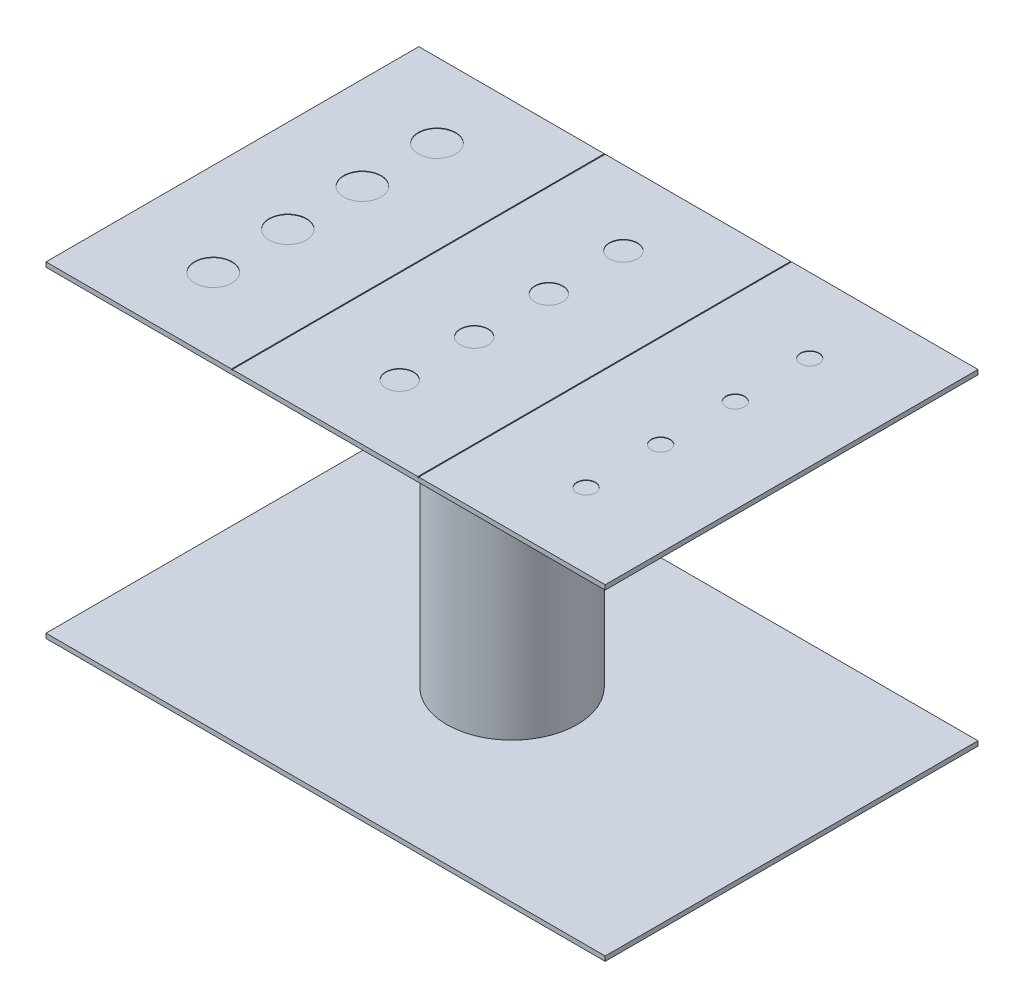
ISO-10303-21;
HEADER;
FILE_DESCRIPTION(('STEP AP214'),'2;1');
FILE_NAME('part.step','',(''),(''),'','','');
FILE_SCHEMA(('AUTOMOTIVE_DESIGN { 1 0 10303 214 1 1 1 1 }'));
ENDSEC;
DATA;
#1=APPLICATION_CONTEXT('core data for automotive mechanical design processes');
#2=APPLICATION_PROTOCOL_DEFINITION('international standard','automotive_design',2000,#1);
#3=PRODUCT_CONTEXT('',#1,'mechanical');
#4=PRODUCT('Part','Part','',(#3));
#5=PRODUCT_RELATED_PRODUCT_CATEGORY('part','',(#4));
#6=PRODUCT_DEFINITION_FORMATION('','',#4);
#7=PRODUCT_DEFINITION_CONTEXT('part definition',#1,'design');
#8=PRODUCT_DEFINITION('design','',#6,#7);
#9=PRODUCT_DEFINITION_SHAPE('','',#8);
#10=(LENGTH_UNIT() NAMED_UNIT(*) SI_UNIT(.MILLI.,.METRE.));
#11=(NAMED_UNIT(*) PLANE_ANGLE_UNIT() SI_UNIT($,.RADIAN.));
#12=(NAMED_UNIT(*) SI_UNIT($,.STERADIAN.) SOLID_ANGLE_UNIT());
#13=UNCERTAINTY_MEASURE_WITH_UNIT(LENGTH_MEASURE(1.E-05),#10,'distance_accuracy_value','');
#14=(GEOMETRIC_REPRESENTATION_CONTEXT(3) GLOBAL_UNCERTAINTY_ASSIGNED_CONTEXT((#13)) GLOBAL_UNIT_ASSIGNED_CONTEXT((#10,
#11,#12)) REPRESENTATION_CONTEXT('',''));
#15=CARTESIAN_POINT('',(0.,0.,0.));
#16=DIRECTION('',(0.,0.,1.));
#17=DIRECTION('',(1.,0.,0.));
#18=AXIS2_PLACEMENT_3D('',#15,#16,#17);
#19=CARTESIAN_POINT('',(0.,350.,0.));
#20=DIRECTION('',(0.,1.,0.));
#21=DIRECTION('',(0.,0.,1.));
#22=AXIS2_PLACEMENT_3D('',#19,#20,#21);
#23=PLANE('',#22);
#24=CARTESIAN_POINT('',(199.499999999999,350.,-120.));
#25=DIRECTION('',(0.,1.,0.));
#26=DIRECTION('',(0.,0.,1.));
#27=AXIS2_PLACEMENT_3D('',#24,#25,#26);
#28=CIRCLE('',#27,10.);
#29=CARTESIAN_POINT('',(199.499999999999,350.,-110.));
#30=VERTEX_POINT('',#29);
#31=EDGE_CURVE('E728',#30,#30,#28,.T.);
#32=ORIENTED_EDGE('',*,*,#31,.F.);
#33=EDGE_LOOP('',(#32));
#34=FACE_BOUND('',#33,.T.);
#35=CARTESIAN_POINT('',(199.499999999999,350.,-40.));
#36=DIRECTION('',(0.,1.,0.));
#37=DIRECTION('',(0.,0.,1.));
#38=AXIS2_PLACEMENT_3D('',#35,#36,#37);
#39=CIRCLE('',#38,10.);
#40=CARTESIAN_POINT('',(199.499999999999,350.,-30.));
#41=VERTEX_POINT('',#40);
#42=EDGE_CURVE('E729',#41,#41,#39,.T.);
#43=ORIENTED_EDGE('',*,*,#42,.F.);
#44=EDGE_LOOP('',(#43));
#45=FACE_BOUND('',#44,.T.);
#46=CARTESIAN_POINT('',(199.5,350.,40.));
#47=DIRECTION('',(0.,1.,0.));
#48=DIRECTION('',(0.,0.,1.));
#49=AXIS2_PLACEMENT_3D('',#46,#47,#48);
#50=CIRCLE('',#49,10.);
#51=CARTESIAN_POINT('',(199.5,350.,50.));
#52=VERTEX_POINT('',#51);
#53=EDGE_CURVE('E744',#52,#52,#50,.T.);
#54=ORIENTED_EDGE('',*,*,#53,.F.);
#55=EDGE_LOOP('',(#54));
#56=FACE_BOUND('',#55,.T.);
#57=CARTESIAN_POINT('',(199.5,350.,120.));
#58=DIRECTION('',(0.,1.,0.));
#59=DIRECTION('',(0.,0.,1.));
#60=AXIS2_PLACEMENT_3D('',#57,#58,#59);
#61=CIRCLE('',#60,10.);
#62=CARTESIAN_POINT('',(199.5,350.,130.));
#63=VERTEX_POINT('',#62);
#64=EDGE_CURVE('E752',#63,#63,#61,.T.);
#65=ORIENTED_EDGE('',*,*,#64,.F.);
#66=EDGE_LOOP('',(#65));
#67=FACE_BOUND('',#66,.T.);
#68=DIRECTION('',(-1.,0.,0.));
#69=VECTOR('',#68,1.);
#70=CARTESIAN_POINT('',(-300.,350.,-200.));
#71=LINE('',#70,#69);
#72=CARTESIAN_POINT('',(300.,350.,-200.));
#73=VERTEX_POINT('',#72);
#74=CARTESIAN_POINT('',(100.,350.,-199.999999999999));
#75=VERTEX_POINT('',#74);
#76=EDGE_CURVE('E249',#73,#75,#71,.T.);
#77=ORIENTED_EDGE('',*,*,#76,.T.);
#78=DIRECTION('',(0.,0.,1.));
#79=VECTOR('',#78,1.);
#80=CARTESIAN_POINT('',(100.,350.,-199.999999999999));
#81=LINE('',#80,#79);
#82=CARTESIAN_POINT('',(100.,350.,200.));
#83=VERTEX_POINT('',#82);
#84=EDGE_CURVE('E181',#75,#83,#81,.T.);
#85=ORIENTED_EDGE('',*,*,#84,.T.);
#86=DIRECTION('',(1.,0.,0.));
#87=VECTOR('',#86,1.);
#88=CARTESIAN_POINT('',(-300.,350.,200.));
#89=LINE('',#88,#87);
#90=CARTESIAN_POINT('',(300.,350.,200.));
#91=VERTEX_POINT('',#90);
#92=EDGE_CURVE('E257',#83,#91,#89,.T.);
#93=ORIENTED_EDGE('',*,*,#92,.T.);
#94=DIRECTION('',(0.,0.,-1.));
#95=VECTOR('',#94,1.);
#96=CARTESIAN_POINT('',(300.,350.,-200.));
#97=LINE('',#96,#95);
#98=EDGE_CURVE('E243',#91,#73,#97,.T.);
#99=ORIENTED_EDGE('',*,*,#98,.T.);
#100=EDGE_LOOP('',(#77,#85,#93,#99));
#101=FACE_BOUND('',#100,.T.);
#102=ADVANCED_FACE('F45',(#34,#45,#56,#67,#101),#23,.T.);
#103=CARTESIAN_POINT('',(-0.500000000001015,350.,-119.999999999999));
#104=DIRECTION('',(0.,1.,0.));
#105=DIRECTION('',(0.,0.,1.));
#106=AXIS2_PLACEMENT_3D('',#103,#104,#105);
#107=CIRCLE('',#106,15.);
#108=CARTESIAN_POINT('',(-0.500000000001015,350.,-104.999999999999));
#109=VERTEX_POINT('',#108);
#110=EDGE_CURVE('E775',#109,#109,#107,.T.);
#111=ORIENTED_EDGE('',*,*,#110,.F.);
#112=EDGE_LOOP('',(#111));
#113=FACE_BOUND('',#112,.T.);
#114=CARTESIAN_POINT('',(-0.500000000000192,350.,120.000000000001));
#115=DIRECTION('',(0.,1.,0.));
#116=DIRECTION('',(0.,0.,1.));
#117=AXIS2_PLACEMENT_3D('',#114,#115,#116);
#118=CIRCLE('',#117,15.);
#119=CARTESIAN_POINT('',(-0.500000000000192,350.,135.000000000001));
#120=VERTEX_POINT('',#119);
#121=EDGE_CURVE('E804',#120,#120,#118,.T.);
#122=ORIENTED_EDGE('',*,*,#121,.F.);
#123=EDGE_LOOP('',(#122));
#124=FACE_BOUND('',#123,.T.);
#125=CARTESIAN_POINT('',(-0.500000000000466,350.,40.0000000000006));
#126=DIRECTION('',(0.,1.,0.));
#127=DIRECTION('',(0.,0.,1.));
#128=AXIS2_PLACEMENT_3D('',#125,#126,#127);
#129=CIRCLE('',#128,15.);
#130=CARTESIAN_POINT('',(-0.500000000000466,350.,55.0000000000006));
#131=VERTEX_POINT('',#130);
#132=EDGE_CURVE('E796',#131,#131,#129,.T.);
#133=ORIENTED_EDGE('',*,*,#132,.F.);
#134=EDGE_LOOP('',(#133));
#135=FACE_BOUND('',#134,.T.);
#136=CARTESIAN_POINT('',(-0.50000000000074,350.,-39.9999999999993));
#137=DIRECTION('',(0.,1.,0.));
#138=DIRECTION('',(0.,0.,1.));
#139=AXIS2_PLACEMENT_3D('',#136,#137,#138);
#140=CIRCLE('',#139,15.);
#141=CARTESIAN_POINT('',(-0.50000000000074,350.,-24.9999999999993));
#142=VERTEX_POINT('',#141);
#143=EDGE_CURVE('E788',#142,#142,#140,.T.);
#144=ORIENTED_EDGE('',*,*,#143,.F.);
#145=EDGE_LOOP('',(#144));
#146=FACE_BOUND('',#145,.T.);
#147=DIRECTION('',(0.,0.,-1.));
#148=VECTOR('',#147,1.);
#149=CARTESIAN_POINT('',(99.0000000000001,350.,-199.999999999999));
#150=LINE('',#149,#148);
#151=CARTESIAN_POINT('',(99.0000000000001,350.,-199.999999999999));
#152=VERTEX_POINT('',#151);
#153=CARTESIAN_POINT('',(99.0000000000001,350.,200.000000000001));
#154=VERTEX_POINT('',#153);
#155=EDGE_CURVE('E166',#152,#154,#150,.F.);
#156=ORIENTED_EDGE('',*,*,#155,.F.);
#157=CARTESIAN_POINT('',(-99.9999999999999,350.,-199.999999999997));
#158=VERTEX_POINT('',#157);
#159=EDGE_CURVE('E254',#152,#158,#71,.T.);
#160=ORIENTED_EDGE('',*,*,#159,.T.);
#161=DIRECTION('',(0.,0.,1.));
#162=VECTOR('',#161,1.);
#163=CARTESIAN_POINT('',(-99.9999999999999,350.,-199.999999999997));
#164=LINE('',#163,#162);
#165=CARTESIAN_POINT('',(-99.9999999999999,350.,200.));
#166=VERTEX_POINT('',#165);
#167=EDGE_CURVE('E214',#158,#166,#164,.T.);
#168=ORIENTED_EDGE('',*,*,#167,.T.);
#169=EDGE_CURVE('E263',#166,#154,#89,.T.);
#170=ORIENTED_EDGE('',*,*,#169,.T.);
#171=EDGE_LOOP('',(#156,#160,#168,#170));
#172=FACE_BOUND('',#171,.T.);
#173=ADVANCED_FACE('F367',(#113,#124,#135,#146,#172),#23,.T.);
#174=CARTESIAN_POINT('',(300.,5.,-200.));
#175=DIRECTION('',(-1.,0.,0.));
#176=DIRECTION('',(0.,0.,1.));
#177=AXIS2_PLACEMENT_3D('',#174,#175,#176);
#178=PLANE('',#177);
#179=DIRECTION('',(0.,0.,-1.));
#180=VECTOR('',#179,1.);
#181=CARTESIAN_POINT('',(300.,0.,-200.));
#182=LINE('',#181,#180);
#183=CARTESIAN_POINT('',(300.,0.,200.));
#184=VERTEX_POINT('',#183);
#185=CARTESIAN_POINT('',(300.,0.,-200.));
#186=VERTEX_POINT('',#185);
#187=EDGE_CURVE('E293',#184,#186,#182,.T.);
#188=ORIENTED_EDGE('',*,*,#187,.T.);
#189=DIRECTION('',(0.,-1.,0.));
#190=VECTOR('',#189,1.);
#191=CARTESIAN_POINT('',(300.,5.,-200.));
#192=LINE('',#191,#190);
#193=CARTESIAN_POINT('',(300.,5.,-200.));
#194=VERTEX_POINT('',#193);
#195=EDGE_CURVE('E49',#194,#186,#192,.T.);
#196=ORIENTED_EDGE('',*,*,#195,.F.);
#197=DIRECTION('',(0.,0.,-1.));
#198=VECTOR('',#197,1.);
#199=CARTESIAN_POINT('',(300.,5.,-200.));
#200=LINE('',#199,#198);
#201=CARTESIAN_POINT('',(300.,5.,200.));
#202=VERTEX_POINT('',#201);
#203=EDGE_CURVE('E295',#202,#194,#200,.T.);
#204=ORIENTED_EDGE('',*,*,#203,.F.);
#205=DIRECTION('',(0.,-1.,0.));
#206=VECTOR('',#205,1.);
#207=CARTESIAN_POINT('',(300.,5.,200.));
#208=LINE('',#207,#206);
#209=EDGE_CURVE('E309',#202,#184,#208,.T.);
#210=ORIENTED_EDGE('',*,*,#209,.T.);
#211=EDGE_LOOP('',(#188,#196,#204,#210));
#212=FACE_BOUND('',#211,.T.);
#213=ADVANCED_FACE('F47',(#212),#178,.F.);
#214=CARTESIAN_POINT('',(-300.,5.,-200.));
#215=DIRECTION('',(0.,0.,1.));
#216=DIRECTION('',(1.,0.,0.));
#217=AXIS2_PLACEMENT_3D('',#214,#215,#216);
#218=PLANE('',#217);
#219=DIRECTION('',(-1.,0.,0.));
#220=VECTOR('',#219,1.);
#221=CARTESIAN_POINT('',(-300.,0.,-200.));
#222=LINE('',#221,#220);
#223=CARTESIAN_POINT('',(-300.,0.,-200.));
#224=VERTEX_POINT('',#223);
#225=EDGE_CURVE('E313',#186,#224,#222,.T.);
#226=ORIENTED_EDGE('',*,*,#225,.T.);
#227=DIRECTION('',(0.,-1.,0.));
#228=VECTOR('',#227,1.);
#229=CARTESIAN_POINT('',(-300.,5.,-200.));
#230=LINE('',#229,#228);
#231=CARTESIAN_POINT('',(-300.,5.,-200.));
#232=VERTEX_POINT('',#231);
#233=EDGE_CURVE('E327',#232,#224,#230,.T.);
#234=ORIENTED_EDGE('',*,*,#233,.F.);
#235=DIRECTION('',(-1.,0.,0.));
#236=VECTOR('',#235,1.);
#237=CARTESIAN_POINT('',(-300.,5.,-200.));
#238=LINE('',#237,#236);
#239=EDGE_CURVE('E299',#194,#232,#238,.T.);
#240=ORIENTED_EDGE('',*,*,#239,.F.);
#241=ORIENTED_EDGE('',*,*,#195,.T.);
#242=EDGE_LOOP('',(#226,#234,#240,#241));
#243=FACE_BOUND('',#242,.T.);
#244=ADVANCED_FACE('F338',(#243),#218,.F.);
#245=CARTESIAN_POINT('',(-300.,5.,-200.));
#246=DIRECTION('',(1.,0.,0.));
#247=DIRECTION('',(0.,0.,-1.));
#248=AXIS2_PLACEMENT_3D('',#245,#246,#247);
#249=PLANE('',#248);
#250=DIRECTION('',(0.,0.,1.));
#251=VECTOR('',#250,1.);
#252=CARTESIAN_POINT('',(-300.,0.,-200.));
#253=LINE('',#252,#251);
#254=CARTESIAN_POINT('',(-300.,0.,200.));
#255=VERTEX_POINT('',#254);
#256=EDGE_CURVE('E316',#224,#255,#253,.T.);
#257=ORIENTED_EDGE('',*,*,#256,.T.);
#258=DIRECTION('',(0.,-1.,0.));
#259=VECTOR('',#258,1.);
#260=CARTESIAN_POINT('',(-300.,5.,200.));
#261=LINE('',#260,#259);
#262=CARTESIAN_POINT('',(-300.,5.,200.));
#263=VERTEX_POINT('',#262);
#264=EDGE_CURVE('E324',#263,#255,#261,.T.);
#265=ORIENTED_EDGE('',*,*,#264,.F.);
#266=DIRECTION('',(0.,0.,1.));
#267=VECTOR('',#266,1.);
#268=CARTESIAN_POINT('',(-300.,5.,-200.));
#269=LINE('',#268,#267);
#270=EDGE_CURVE('E303',#232,#263,#269,.T.);
#271=ORIENTED_EDGE('',*,*,#270,.F.);
#272=ORIENTED_EDGE('',*,*,#233,.T.);
#273=EDGE_LOOP('',(#257,#265,#271,#272));
#274=FACE_BOUND('',#273,.T.);
#275=ADVANCED_FACE('F347',(#274),#249,.F.);
#276=CARTESIAN_POINT('',(-300.,5.,200.));
#277=DIRECTION('',(0.,0.,-1.));
#278=DIRECTION('',(-1.,0.,0.));
#279=AXIS2_PLACEMENT_3D('',#276,#277,#278);
#280=PLANE('',#279);
#281=DIRECTION('',(1.,0.,0.));
#282=VECTOR('',#281,1.);
#283=CARTESIAN_POINT('',(-300.,0.,200.));
#284=LINE('',#283,#282);
#285=EDGE_CURVE('E300',#255,#184,#284,.T.);
#286=ORIENTED_EDGE('',*,*,#285,.T.);
#287=ORIENTED_EDGE('',*,*,#209,.F.);
#288=DIRECTION('',(1.,0.,0.));
#289=VECTOR('',#288,1.);
#290=CARTESIAN_POINT('',(-300.,5.,200.));
#291=LINE('',#290,#289);
#292=EDGE_CURVE('E306',#263,#202,#291,.T.);
#293=ORIENTED_EDGE('',*,*,#292,.F.);
#294=ORIENTED_EDGE('',*,*,#264,.T.);
#295=EDGE_LOOP('',(#286,#287,#293,#294));
#296=FACE_BOUND('',#295,.T.);
#297=ADVANCED_FACE('F350',(#296),#280,.F.);
#298=CARTESIAN_POINT('',(0.,5.,0.));
#299=DIRECTION('',(0.,1.,0.));
#300=DIRECTION('',(0.,0.,1.));
#301=AXIS2_PLACEMENT_3D('',#298,#299,#300);
#302=PLANE('',#301);
#303=CARTESIAN_POINT('',(0.,5.,0.));
#304=DIRECTION('',(0.,1.,0.));
#305=DIRECTION('',(0.,0.,1.));
#306=AXIS2_PLACEMENT_3D('',#303,#304,#305);
#307=CIRCLE('',#306,70.);
#308=CARTESIAN_POINT('',(0.,5.,70.));
#309=VERTEX_POINT('',#308);
#310=EDGE_CURVE('E11',#309,#309,#307,.T.);
#311=ORIENTED_EDGE('',*,*,#310,.F.);
#312=EDGE_LOOP('',(#311));
#313=FACE_BOUND('',#312,.T.);
#314=ORIENTED_EDGE('',*,*,#203,.T.);
#315=ORIENTED_EDGE('',*,*,#239,.T.);
#316=ORIENTED_EDGE('',*,*,#270,.T.);
#317=ORIENTED_EDGE('',*,*,#292,.T.);
#318=EDGE_LOOP('',(#314,#315,#316,#317));
#319=FACE_BOUND('',#318,.T.);
#320=ADVANCED_FACE('F352',(#313,#319),#302,.T.);
#321=CARTESIAN_POINT('',(0.,0.,0.));
#322=DIRECTION('',(0.,1.,0.));
#323=DIRECTION('',(0.,0.,1.));
#324=AXIS2_PLACEMENT_3D('',#321,#322,#323);
#325=PLANE('',#324);
#326=ORIENTED_EDGE('',*,*,#187,.F.);
#327=ORIENTED_EDGE('',*,*,#285,.F.);
#328=ORIENTED_EDGE('',*,*,#256,.F.);
#329=ORIENTED_EDGE('',*,*,#225,.F.);
#330=EDGE_LOOP('',(#326,#327,#328,#329));
#331=FACE_BOUND('',#330,.T.);
#332=ADVANCED_FACE('F345',(#331),#325,.F.);
#333=CARTESIAN_POINT('',(0.,345.,0.));
#334=DIRECTION('',(0.,-1.,0.));
#335=DIRECTION('',(0.,0.,-1.));
#336=AXIS2_PLACEMENT_3D('',#333,#334,#335);
#337=CYLINDRICAL_SURFACE('',#336,70.);
#338=CARTESIAN_POINT('',(0.,345.,0.));
#339=DIRECTION('',(0.,1.,0.));
#340=DIRECTION('',(0.,0.,1.));
#341=AXIS2_PLACEMENT_3D('',#338,#339,#340);
#342=CIRCLE('',#341,70.);
#343=CARTESIAN_POINT('',(0.,345.,70.));
#344=VERTEX_POINT('',#343);
#345=EDGE_CURVE('E290',#344,#344,#342,.T.);
#346=ORIENTED_EDGE('',*,*,#345,.F.);
#347=EDGE_LOOP('',(#346));
#348=FACE_BOUND('',#347,.T.);
#349=ORIENTED_EDGE('',*,*,#310,.T.);
#350=EDGE_LOOP('',(#349));
#351=FACE_BOUND('',#350,.T.);
#352=ADVANCED_FACE('F360',(#348,#351),#337,.T.);
#353=CARTESIAN_POINT('',(300.,350.,-200.));
#354=DIRECTION('',(-1.,0.,0.));
#355=DIRECTION('',(0.,0.,1.));
#356=AXIS2_PLACEMENT_3D('',#353,#354,#355);
#357=PLANE('',#356);
#358=DIRECTION('',(0.,0.,-1.));
#359=VECTOR('',#358,1.);
#360=CARTESIAN_POINT('',(300.,345.,-200.));
#361=LINE('',#360,#359);
#362=CARTESIAN_POINT('',(300.,345.,200.));
#363=VERTEX_POINT('',#362);
#364=CARTESIAN_POINT('',(300.,345.,-200.));
#365=VERTEX_POINT('',#364);
#366=EDGE_CURVE('E202',#363,#365,#361,.T.);
#367=ORIENTED_EDGE('',*,*,#366,.T.);
#368=DIRECTION('',(0.,-1.,0.));
#369=VECTOR('',#368,1.);
#370=CARTESIAN_POINT('',(300.,350.,-200.));
#371=LINE('',#370,#369);
#372=EDGE_CURVE('E286',#73,#365,#371,.T.);
#373=ORIENTED_EDGE('',*,*,#372,.F.);
#374=ORIENTED_EDGE('',*,*,#98,.F.);
#375=DIRECTION('',(0.,-1.,0.));
#376=VECTOR('',#375,1.);
#377=CARTESIAN_POINT('',(300.,350.,200.));
#378=LINE('',#377,#376);
#379=EDGE_CURVE('E262',#91,#363,#378,.T.);
#380=ORIENTED_EDGE('',*,*,#379,.T.);
#381=EDGE_LOOP('',(#367,#373,#374,#380));
#382=FACE_BOUND('',#381,.T.);
#383=ADVANCED_FACE('F437',(#382),#357,.F.);
#384=CARTESIAN_POINT('',(-300.,350.,-200.));
#385=DIRECTION('',(0.,0.,1.));
#386=DIRECTION('',(1.,0.,0.));
#387=AXIS2_PLACEMENT_3D('',#384,#385,#386);
#388=PLANE('',#387);
#389=ORIENTED_EDGE('',*,*,#159,.F.);
#390=DIRECTION('',(0.,1.,0.));
#391=VECTOR('',#390,1.);
#392=CARTESIAN_POINT('',(99.0000000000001,349.,-199.999999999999));
#393=LINE('',#392,#391);
#394=CARTESIAN_POINT('',(99.0000000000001,349.,-199.999999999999));
#395=VERTEX_POINT('',#394);
#396=EDGE_CURVE('E199',#395,#152,#393,.T.);
#397=ORIENTED_EDGE('',*,*,#396,.F.);
#398=DIRECTION('',(1.,0.,0.));
#399=VECTOR('',#398,1.);
#400=CARTESIAN_POINT('',(99.0000000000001,349.,-199.999999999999));
#401=LINE('',#400,#399);
#402=CARTESIAN_POINT('',(100.,349.,-199.999999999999));
#403=VERTEX_POINT('',#402);
#404=EDGE_CURVE('E172',#395,#403,#401,.T.);
#405=ORIENTED_EDGE('',*,*,#404,.T.);
#406=DIRECTION('',(0.,1.,0.));
#407=VECTOR('',#406,1.);
#408=CARTESIAN_POINT('',(100.,349.,-199.999999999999));
#409=LINE('',#408,#407);
#410=EDGE_CURVE('E203',#403,#75,#409,.T.);
#411=ORIENTED_EDGE('',*,*,#410,.T.);
#412=ORIENTED_EDGE('',*,*,#76,.F.);
#413=ORIENTED_EDGE('',*,*,#372,.T.);
#414=DIRECTION('',(-1.,0.,0.));
#415=VECTOR('',#414,1.);
#416=CARTESIAN_POINT('',(-300.,345.,-200.));
#417=LINE('',#416,#415);
#418=CARTESIAN_POINT('',(-300.,345.,-200.));
#419=VERTEX_POINT('',#418);
#420=EDGE_CURVE('E267',#365,#419,#417,.T.);
#421=ORIENTED_EDGE('',*,*,#420,.T.);
#422=DIRECTION('',(0.,-1.,0.));
#423=VECTOR('',#422,1.);
#424=CARTESIAN_POINT('',(-300.,350.,-200.));
#425=LINE('',#424,#423);
#426=CARTESIAN_POINT('',(-300.,350.,-200.));
#427=VERTEX_POINT('',#426);
#428=EDGE_CURVE('E282',#427,#419,#425,.T.);
#429=ORIENTED_EDGE('',*,*,#428,.F.);
#430=CARTESIAN_POINT('',(-101.,350.,-199.999999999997));
#431=VERTEX_POINT('',#430);
#432=EDGE_CURVE('E247',#431,#427,#71,.T.);
#433=ORIENTED_EDGE('',*,*,#432,.F.);
#434=DIRECTION('',(0.,1.,0.));
#435=VECTOR('',#434,1.);
#436=CARTESIAN_POINT('',(-101.,349.,-199.999999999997));
#437=LINE('',#436,#435);
#438=CARTESIAN_POINT('',(-101.,349.,-199.999999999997));
#439=VERTEX_POINT('',#438);
#440=EDGE_CURVE('E196',#439,#431,#437,.T.);
#441=ORIENTED_EDGE('',*,*,#440,.F.);
#442=DIRECTION('',(1.,0.,0.));
#443=VECTOR('',#442,1.);
#444=CARTESIAN_POINT('',(-101.,349.,-199.999999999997));
#445=LINE('',#444,#443);
#446=CARTESIAN_POINT('',(-99.9999999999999,349.,-199.999999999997));
#447=VERTEX_POINT('',#446);
#448=EDGE_CURVE('E221',#439,#447,#445,.T.);
#449=ORIENTED_EDGE('',*,*,#448,.T.);
#450=DIRECTION('',(0.,1.,0.));
#451=VECTOR('',#450,1.);
#452=CARTESIAN_POINT('',(-99.9999999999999,349.,-199.999999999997));
#453=LINE('',#452,#451);
#454=EDGE_CURVE('E234',#447,#158,#453,.T.);
#455=ORIENTED_EDGE('',*,*,#454,.T.);
#456=EDGE_LOOP('',(#389,#397,#405,#411,#412,#413,#421,#429,#433,#441,#449,#455));
#457=FACE_BOUND('',#456,.T.);
#458=ADVANCED_FACE('F416',(#457),#388,.F.);
#459=CARTESIAN_POINT('',(-300.,350.,-200.));
#460=DIRECTION('',(1.,0.,0.));
#461=DIRECTION('',(0.,0.,-1.));
#462=AXIS2_PLACEMENT_3D('',#459,#460,#461);
#463=PLANE('',#462);
#464=DIRECTION('',(0.,0.,1.));
#465=VECTOR('',#464,1.);
#466=CARTESIAN_POINT('',(-300.,345.,-200.));
#467=LINE('',#466,#465);
#468=CARTESIAN_POINT('',(-300.,345.,200.));
#469=VERTEX_POINT('',#468);
#470=EDGE_CURVE('E270',#419,#469,#467,.T.);
#471=ORIENTED_EDGE('',*,*,#470,.T.);
#472=DIRECTION('',(0.,-1.,0.));
#473=VECTOR('',#472,1.);
#474=CARTESIAN_POINT('',(-300.,350.,200.));
#475=LINE('',#474,#473);
#476=CARTESIAN_POINT('',(-300.,350.,200.));
#477=VERTEX_POINT('',#476);
#478=EDGE_CURVE('E278',#477,#469,#475,.T.);
#479=ORIENTED_EDGE('',*,*,#478,.F.);
#480=DIRECTION('',(0.,0.,1.));
#481=VECTOR('',#480,1.);
#482=CARTESIAN_POINT('',(-300.,350.,-200.));
#483=LINE('',#482,#481);
#484=EDGE_CURVE('E253',#427,#477,#483,.T.);
#485=ORIENTED_EDGE('',*,*,#484,.F.);
#486=ORIENTED_EDGE('',*,*,#428,.T.);
#487=EDGE_LOOP('',(#471,#479,#485,#486));
#488=FACE_BOUND('',#487,.T.);
#489=ADVANCED_FACE('F390',(#488),#463,.F.);
#490=CARTESIAN_POINT('',(-300.,350.,200.));
#491=DIRECTION('',(0.,0.,-1.));
#492=DIRECTION('',(-1.,0.,0.));
#493=AXIS2_PLACEMENT_3D('',#490,#491,#492);
#494=PLANE('',#493);
#495=DIRECTION('',(-1.,0.,0.));
#496=VECTOR('',#495,1.);
#497=CARTESIAN_POINT('',(100.,349.,200.000000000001));
#498=LINE('',#497,#496);
#499=CARTESIAN_POINT('',(100.,349.,200.000000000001));
#500=VERTEX_POINT('',#499);
#501=CARTESIAN_POINT('',(99.0000000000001,349.,200.000000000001));
#502=VERTEX_POINT('',#501);
#503=EDGE_CURVE('E178',#500,#502,#498,.T.);
#504=ORIENTED_EDGE('',*,*,#503,.T.);
#505=DIRECTION('',(0.,1.,0.));
#506=VECTOR('',#505,1.);
#507=CARTESIAN_POINT('',(99.0000000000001,349.,200.000000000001));
#508=LINE('',#507,#506);
#509=EDGE_CURVE('E160',#502,#154,#508,.T.);
#510=ORIENTED_EDGE('',*,*,#509,.T.);
#511=ORIENTED_EDGE('',*,*,#169,.F.);
#512=DIRECTION('',(0.,1.,0.));
#513=VECTOR('',#512,1.);
#514=CARTESIAN_POINT('',(-99.9999999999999,349.,200.000000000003));
#515=LINE('',#514,#513);
#516=CARTESIAN_POINT('',(-99.9999999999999,349.,200.000000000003));
#517=VERTEX_POINT('',#516);
#518=EDGE_CURVE('E70',#517,#166,#515,.T.);
#519=ORIENTED_EDGE('',*,*,#518,.F.);
#520=DIRECTION('',(-1.,0.,0.));
#521=VECTOR('',#520,1.);
#522=CARTESIAN_POINT('',(-99.9999999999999,349.,200.000000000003));
#523=LINE('',#522,#521);
#524=CARTESIAN_POINT('',(-101.,349.,200.000000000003));
#525=VERTEX_POINT('',#524);
#526=EDGE_CURVE('E213',#517,#525,#523,.T.);
#527=ORIENTED_EDGE('',*,*,#526,.T.);
#528=DIRECTION('',(0.,1.,0.));
#529=VECTOR('',#528,1.);
#530=CARTESIAN_POINT('',(-101.,349.,200.000000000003));
#531=LINE('',#530,#529);
#532=CARTESIAN_POINT('',(-101.,350.,200.000000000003));
#533=VERTEX_POINT('',#532);
#534=EDGE_CURVE('E225',#525,#533,#531,.T.);
#535=ORIENTED_EDGE('',*,*,#534,.T.);
#536=EDGE_CURVE('E258',#477,#533,#89,.T.);
#537=ORIENTED_EDGE('',*,*,#536,.F.);
#538=ORIENTED_EDGE('',*,*,#478,.T.);
#539=DIRECTION('',(1.,0.,0.));
#540=VECTOR('',#539,1.);
#541=CARTESIAN_POINT('',(-300.,345.,200.));
#542=LINE('',#541,#540);
#543=EDGE_CURVE('E248',#469,#363,#542,.T.);
#544=ORIENTED_EDGE('',*,*,#543,.T.);
#545=ORIENTED_EDGE('',*,*,#379,.F.);
#546=ORIENTED_EDGE('',*,*,#92,.F.);
#547=DIRECTION('',(0.,1.,0.));
#548=VECTOR('',#547,1.);
#549=CARTESIAN_POINT('',(100.,349.,200.000000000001));
#550=LINE('',#549,#548);
#551=EDGE_CURVE('E62',#500,#83,#550,.T.);
#552=ORIENTED_EDGE('',*,*,#551,.F.);
#553=EDGE_LOOP('',(#504,#510,#511,#519,#527,#535,#537,#538,#544,#545,#546,#552));
#554=FACE_BOUND('',#553,.T.);
#555=ADVANCED_FACE('F183',(#554),#494,.F.);
#556=CARTESIAN_POINT('',(-200.5,350.,120.));
#557=DIRECTION('',(0.,1.,0.));
#558=DIRECTION('',(0.,0.,1.));
#559=AXIS2_PLACEMENT_3D('',#556,#557,#558);
#560=CIRCLE('',#559,20.);
#561=CARTESIAN_POINT('',(-200.5,350.,140.));
#562=VERTEX_POINT('',#561);
#563=EDGE_CURVE('E395',#562,#562,#560,.T.);
#564=ORIENTED_EDGE('',*,*,#563,.F.);
#565=EDGE_LOOP('',(#564));
#566=FACE_BOUND('',#565,.T.);
#567=CARTESIAN_POINT('',(-200.5,350.,40.));
#568=DIRECTION('',(0.,1.,0.));
#569=DIRECTION('',(0.,0.,1.));
#570=AXIS2_PLACEMENT_3D('',#567,#568,#569);
#571=CIRCLE('',#570,20.);
#572=CARTESIAN_POINT('',(-200.5,350.,60.));
#573=VERTEX_POINT('',#572);
#574=EDGE_CURVE('E399',#573,#573,#571,.T.);
#575=ORIENTED_EDGE('',*,*,#574,.F.);
#576=EDGE_LOOP('',(#575));
#577=FACE_BOUND('',#576,.T.);
#578=CARTESIAN_POINT('',(-200.500000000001,350.,-40.));
#579=DIRECTION('',(0.,1.,0.));
#580=DIRECTION('',(0.,0.,1.));
#581=AXIS2_PLACEMENT_3D('',#578,#579,#580);
#582=CIRCLE('',#581,20.);
#583=CARTESIAN_POINT('',(-200.500000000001,350.,-20.));
#584=VERTEX_POINT('',#583);
#585=EDGE_CURVE('E403',#584,#584,#582,.T.);
#586=ORIENTED_EDGE('',*,*,#585,.F.);
#587=EDGE_LOOP('',(#586));
#588=FACE_BOUND('',#587,.T.);
#589=CARTESIAN_POINT('',(-200.500000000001,350.,-120.));
#590=DIRECTION('',(0.,1.,0.));
#591=DIRECTION('',(0.,0.,1.));
#592=AXIS2_PLACEMENT_3D('',#589,#590,#591);
#593=CIRCLE('',#592,20.);
#594=CARTESIAN_POINT('',(-200.500000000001,350.,-100.));
#595=VERTEX_POINT('',#594);
#596=EDGE_CURVE('E407',#595,#595,#593,.T.);
#597=ORIENTED_EDGE('',*,*,#596,.F.);
#598=EDGE_LOOP('',(#597));
#599=FACE_BOUND('',#598,.T.);
#600=DIRECTION('',(0.,0.,-1.));
#601=VECTOR('',#600,1.);
#602=CARTESIAN_POINT('',(-101.,350.,-199.999999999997));
#603=LINE('',#602,#601);
#604=EDGE_CURVE('E226',#431,#533,#603,.F.);
#605=ORIENTED_EDGE('',*,*,#604,.F.);
#606=ORIENTED_EDGE('',*,*,#432,.T.);
#607=ORIENTED_EDGE('',*,*,#484,.T.);
#608=ORIENTED_EDGE('',*,*,#536,.T.);
#609=EDGE_LOOP('',(#605,#606,#607,#608));
#610=FACE_BOUND('',#609,.T.);
#611=ADVANCED_FACE('F370',(#566,#577,#588,#599,#610),#23,.T.);
#612=CARTESIAN_POINT('',(0.,345.,0.));
#613=DIRECTION('',(0.,1.,0.));
#614=DIRECTION('',(0.,0.,1.));
#615=AXIS2_PLACEMENT_3D('',#612,#613,#614);
#616=PLANE('',#615);
#617=ORIENTED_EDGE('',*,*,#345,.T.);
#618=EDGE_LOOP('',(#617));
#619=FACE_BOUND('',#618,.T.);
#620=ORIENTED_EDGE('',*,*,#366,.F.);
#621=ORIENTED_EDGE('',*,*,#543,.F.);
#622=ORIENTED_EDGE('',*,*,#470,.F.);
#623=ORIENTED_EDGE('',*,*,#420,.F.);
#624=EDGE_LOOP('',(#620,#621,#622,#623));
#625=FACE_BOUND('',#624,.T.);
#626=ADVANCED_FACE('F381',(#619,#625),#616,.F.);
#627=CARTESIAN_POINT('',(-101.,349.,-199.999999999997));
#628=DIRECTION('',(-1.,0.,0.));
#629=DIRECTION('',(0.,0.,1.));
#630=AXIS2_PLACEMENT_3D('',#627,#628,#629);
#631=PLANE('',#630);
#632=ORIENTED_EDGE('',*,*,#604,.T.);
#633=ORIENTED_EDGE('',*,*,#534,.F.);
#634=DIRECTION('',(0.,0.,-1.));
#635=VECTOR('',#634,1.);
#636=CARTESIAN_POINT('',(-101.,349.,-199.999999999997));
#637=LINE('',#636,#635);
#638=EDGE_CURVE('E209',#439,#525,#637,.F.);
#639=ORIENTED_EDGE('',*,*,#638,.F.);
#640=ORIENTED_EDGE('',*,*,#440,.T.);
#641=EDGE_LOOP('',(#632,#633,#639,#640));
#642=FACE_BOUND('',#641,.T.);
#643=ADVANCED_FACE('F387',(#642),#631,.F.);
#644=CARTESIAN_POINT('',(-99.9999999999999,349.,-199.999999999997));
#645=DIRECTION('',(-1.,0.,0.));
#646=DIRECTION('',(0.,0.,1.));
#647=AXIS2_PLACEMENT_3D('',#644,#645,#646);
#648=PLANE('',#647);
#649=ORIENTED_EDGE('',*,*,#167,.F.);
#650=ORIENTED_EDGE('',*,*,#454,.F.);
#651=DIRECTION('',(0.,0.,1.));
#652=VECTOR('',#651,1.);
#653=CARTESIAN_POINT('',(-99.9999999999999,349.,-199.999999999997));
#654=LINE('',#653,#652);
#655=EDGE_CURVE('E218',#447,#517,#654,.T.);
#656=ORIENTED_EDGE('',*,*,#655,.T.);
#657=ORIENTED_EDGE('',*,*,#518,.T.);
#658=EDGE_LOOP('',(#649,#650,#656,#657));
#659=FACE_BOUND('',#658,.T.);
#660=ADVANCED_FACE('F423',(#659),#648,.T.);
#661=CARTESIAN_POINT('',(0.,349.,0.));
#662=DIRECTION('',(0.,1.,0.));
#663=DIRECTION('',(1.,0.,0.));
#664=AXIS2_PLACEMENT_3D('',#661,#662,#663);
#665=PLANE('',#664);
#666=ORIENTED_EDGE('',*,*,#638,.T.);
#667=ORIENTED_EDGE('',*,*,#526,.F.);
#668=ORIENTED_EDGE('',*,*,#655,.F.);
#669=ORIENTED_EDGE('',*,*,#448,.F.);
#670=EDGE_LOOP('',(#666,#667,#668,#669));
#671=FACE_BOUND('',#670,.T.);
#672=ADVANCED_FACE('F426',(#671),#665,.T.);
#673=CARTESIAN_POINT('',(99.0000000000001,349.,-199.999999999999));
#674=DIRECTION('',(-1.,0.,0.));
#675=DIRECTION('',(0.,0.,1.));
#676=AXIS2_PLACEMENT_3D('',#673,#674,#675);
#677=PLANE('',#676);
#678=ORIENTED_EDGE('',*,*,#155,.T.);
#679=ORIENTED_EDGE('',*,*,#509,.F.);
#680=DIRECTION('',(0.,0.,-1.));
#681=VECTOR('',#680,1.);
#682=CARTESIAN_POINT('',(99.0000000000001,349.,-199.999999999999));
#683=LINE('',#682,#681);
#684=EDGE_CURVE('E163',#395,#502,#683,.F.);
#685=ORIENTED_EDGE('',*,*,#684,.F.);
#686=ORIENTED_EDGE('',*,*,#396,.T.);
#687=EDGE_LOOP('',(#678,#679,#685,#686));
#688=FACE_BOUND('',#687,.T.);
#689=ADVANCED_FACE('F162',(#688),#677,.F.);
#690=CARTESIAN_POINT('',(100.,349.,-199.999999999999));
#691=DIRECTION('',(-1.,0.,0.));
#692=DIRECTION('',(0.,0.,1.));
#693=AXIS2_PLACEMENT_3D('',#690,#691,#692);
#694=PLANE('',#693);
#695=ORIENTED_EDGE('',*,*,#84,.F.);
#696=ORIENTED_EDGE('',*,*,#410,.F.);
#697=DIRECTION('',(0.,0.,1.));
#698=VECTOR('',#697,1.);
#699=CARTESIAN_POINT('',(100.,349.,-199.999999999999));
#700=LINE('',#699,#698);
#701=EDGE_CURVE('E186',#403,#500,#700,.T.);
#702=ORIENTED_EDGE('',*,*,#701,.T.);
#703=ORIENTED_EDGE('',*,*,#551,.T.);
#704=EDGE_LOOP('',(#695,#696,#702,#703));
#705=FACE_BOUND('',#704,.T.);
#706=ADVANCED_FACE('F438',(#705),#694,.T.);
#707=CARTESIAN_POINT('',(0.,349.,0.));
#708=DIRECTION('',(0.,1.,0.));
#709=DIRECTION('',(1.,0.,0.));
#710=AXIS2_PLACEMENT_3D('',#707,#708,#709);
#711=PLANE('',#710);
#712=ORIENTED_EDGE('',*,*,#684,.T.);
#713=ORIENTED_EDGE('',*,*,#503,.F.);
#714=ORIENTED_EDGE('',*,*,#701,.F.);
#715=ORIENTED_EDGE('',*,*,#404,.F.);
#716=EDGE_LOOP('',(#712,#713,#714,#715));
#717=FACE_BOUND('',#716,.T.);
#718=ADVANCED_FACE('F176',(#717),#711,.T.);
#719=CARTESIAN_POINT('',(-200.500000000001,349.5,-120.));
#720=DIRECTION('',(0.,1.,0.));
#721=DIRECTION('',(0.,0.,1.));
#722=AXIS2_PLACEMENT_3D('',#719,#720,#721);
#723=CYLINDRICAL_SURFACE('',#722,20.);
#724=CARTESIAN_POINT('',(-200.500000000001,349.5,-120.));
#725=DIRECTION('',(0.,1.,0.));
#726=DIRECTION('',(0.,0.,1.));
#727=AXIS2_PLACEMENT_3D('',#724,#725,#726);
#728=CIRCLE('',#727,20.);
#729=CARTESIAN_POINT('',(-200.500000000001,349.5,-100.));
#730=VERTEX_POINT('',#729);
#731=EDGE_CURVE('E229',#730,#730,#728,.T.);
#732=ORIENTED_EDGE('',*,*,#731,.F.);
#733=EDGE_LOOP('',(#732));
#734=FACE_BOUND('',#733,.T.);
#735=ORIENTED_EDGE('',*,*,#596,.T.);
#736=EDGE_LOOP('',(#735));
#737=FACE_BOUND('',#736,.T.);
#738=ADVANCED_FACE('F444',(#734,#737),#723,.F.);
#739=CARTESIAN_POINT('',(-200.500000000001,349.5,-120.));
#740=DIRECTION('',(0.,1.,0.));
#741=DIRECTION('',(0.,0.,1.));
#742=AXIS2_PLACEMENT_3D('',#739,#740,#741);
#743=PLANE('',#742);
#744=ORIENTED_EDGE('',*,*,#731,.T.);
#745=EDGE_LOOP('',(#744));
#746=FACE_BOUND('',#745,.T.);
#747=ADVANCED_FACE('F492',(#746),#743,.T.);
#748=CARTESIAN_POINT('',(-200.500000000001,349.5,-40.));
#749=DIRECTION('',(0.,1.,0.));
#750=DIRECTION('',(0.,0.,1.));
#751=AXIS2_PLACEMENT_3D('',#748,#749,#750);
#752=CYLINDRICAL_SURFACE('',#751,20.);
#753=CARTESIAN_POINT('',(-200.500000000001,349.5,-40.));
#754=DIRECTION('',(0.,1.,0.));
#755=DIRECTION('',(0.,0.,1.));
#756=AXIS2_PLACEMENT_3D('',#753,#754,#755);
#757=CIRCLE('',#756,20.);
#758=CARTESIAN_POINT('',(-200.500000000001,349.5,-20.));
#759=VERTEX_POINT('',#758);
#760=EDGE_CURVE('E756',#759,#759,#757,.T.);
#761=ORIENTED_EDGE('',*,*,#760,.F.);
#762=EDGE_LOOP('',(#761));
#763=FACE_BOUND('',#762,.T.);
#764=ORIENTED_EDGE('',*,*,#585,.T.);
#765=EDGE_LOOP('',(#764));
#766=FACE_BOUND('',#765,.T.);
#767=ADVANCED_FACE('F501',(#763,#766),#752,.F.);
#768=CARTESIAN_POINT('',(-200.500000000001,349.5,-40.));
#769=DIRECTION('',(0.,1.,0.));
#770=DIRECTION('',(0.,0.,1.));
#771=AXIS2_PLACEMENT_3D('',#768,#769,#770);
#772=PLANE('',#771);
#773=ORIENTED_EDGE('',*,*,#760,.T.);
#774=EDGE_LOOP('',(#773));
#775=FACE_BOUND('',#774,.T.);
#776=ADVANCED_FACE('F511',(#775),#772,.T.);
#777=CARTESIAN_POINT('',(-200.5,349.5,40.));
#778=DIRECTION('',(0.,1.,0.));
#779=DIRECTION('',(0.,0.,1.));
#780=AXIS2_PLACEMENT_3D('',#777,#778,#779);
#781=CYLINDRICAL_SURFACE('',#780,20.);
#782=CARTESIAN_POINT('',(-200.5,349.5,40.));
#783=DIRECTION('',(0.,1.,0.));
#784=DIRECTION('',(0.,0.,1.));
#785=AXIS2_PLACEMENT_3D('',#782,#783,#784);
#786=CIRCLE('',#785,20.);
#787=CARTESIAN_POINT('',(-200.5,349.5,60.));
#788=VERTEX_POINT('',#787);
#789=EDGE_CURVE('E762',#788,#788,#786,.T.);
#790=ORIENTED_EDGE('',*,*,#789,.F.);
#791=EDGE_LOOP('',(#790));
#792=FACE_BOUND('',#791,.T.);
#793=ORIENTED_EDGE('',*,*,#574,.T.);
#794=EDGE_LOOP('',(#793));
#795=FACE_BOUND('',#794,.T.);
#796=ADVANCED_FACE('F521',(#792,#795),#781,.F.);
#797=CARTESIAN_POINT('',(-200.5,349.5,40.));
#798=DIRECTION('',(0.,1.,0.));
#799=DIRECTION('',(0.,0.,1.));
#800=AXIS2_PLACEMENT_3D('',#797,#798,#799);
#801=PLANE('',#800);
#802=ORIENTED_EDGE('',*,*,#789,.T.);
#803=EDGE_LOOP('',(#802));
#804=FACE_BOUND('',#803,.T.);
#805=ADVANCED_FACE('F531',(#804),#801,.T.);
#806=CARTESIAN_POINT('',(-200.5,349.5,120.));
#807=DIRECTION('',(0.,1.,0.));
#808=DIRECTION('',(0.,0.,1.));
#809=AXIS2_PLACEMENT_3D('',#806,#807,#808);
#810=CYLINDRICAL_SURFACE('',#809,20.);
#811=CARTESIAN_POINT('',(-200.5,349.5,120.));
#812=DIRECTION('',(0.,1.,0.));
#813=DIRECTION('',(0.,0.,1.));
#814=AXIS2_PLACEMENT_3D('',#811,#812,#813);
#815=CIRCLE('',#814,20.);
#816=CARTESIAN_POINT('',(-200.5,349.5,140.));
#817=VERTEX_POINT('',#816);
#818=EDGE_CURVE('E768',#817,#817,#815,.T.);
#819=ORIENTED_EDGE('',*,*,#818,.F.);
#820=EDGE_LOOP('',(#819));
#821=FACE_BOUND('',#820,.T.);
#822=ORIENTED_EDGE('',*,*,#563,.T.);
#823=EDGE_LOOP('',(#822));
#824=FACE_BOUND('',#823,.T.);
#825=ADVANCED_FACE('F541',(#821,#824),#810,.F.);
#826=CARTESIAN_POINT('',(-200.5,349.5,120.));
#827=DIRECTION('',(0.,1.,0.));
#828=DIRECTION('',(0.,0.,1.));
#829=AXIS2_PLACEMENT_3D('',#826,#827,#828);
#830=PLANE('',#829);
#831=ORIENTED_EDGE('',*,*,#818,.T.);
#832=EDGE_LOOP('',(#831));
#833=FACE_BOUND('',#832,.T.);
#834=ADVANCED_FACE('F551',(#833),#830,.T.);
#835=CARTESIAN_POINT('',(-0.50000000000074,349.5,-39.9999999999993));
#836=DIRECTION('',(0.,1.,0.));
#837=DIRECTION('',(0.,0.,1.));
#838=AXIS2_PLACEMENT_3D('',#835,#836,#837);
#839=CYLINDRICAL_SURFACE('',#838,15.);
#840=CARTESIAN_POINT('',(-0.50000000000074,349.5,-39.9999999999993));
#841=DIRECTION('',(0.,1.,0.));
#842=DIRECTION('',(0.,0.,1.));
#843=AXIS2_PLACEMENT_3D('',#840,#841,#842);
#844=CIRCLE('',#843,15.);
#845=CARTESIAN_POINT('',(-0.50000000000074,349.5,-24.9999999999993));
#846=VERTEX_POINT('',#845);
#847=EDGE_CURVE('E755',#846,#846,#844,.T.);
#848=ORIENTED_EDGE('',*,*,#847,.F.);
#849=EDGE_LOOP('',(#848));
#850=FACE_BOUND('',#849,.T.);
#851=ORIENTED_EDGE('',*,*,#143,.T.);
#852=EDGE_LOOP('',(#851));
#853=FACE_BOUND('',#852,.T.);
#854=ADVANCED_FACE('F561',(#850,#853),#839,.F.);
#855=CARTESIAN_POINT('',(-0.50000000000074,349.5,-39.9999999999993));
#856=DIRECTION('',(0.,1.,0.));
#857=DIRECTION('',(0.,0.,1.));
#858=AXIS2_PLACEMENT_3D('',#855,#856,#857);
#859=PLANE('',#858);
#860=ORIENTED_EDGE('',*,*,#847,.T.);
#861=EDGE_LOOP('',(#860));
#862=FACE_BOUND('',#861,.T.);
#863=ADVANCED_FACE('F571',(#862),#859,.T.);
#864=CARTESIAN_POINT('',(-0.500000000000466,349.5,40.0000000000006));
#865=DIRECTION('',(0.,1.,0.));
#866=DIRECTION('',(0.,0.,1.));
#867=AXIS2_PLACEMENT_3D('',#864,#865,#866);
#868=CYLINDRICAL_SURFACE('',#867,15.);
#869=CARTESIAN_POINT('',(-0.500000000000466,349.5,40.0000000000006));
#870=DIRECTION('',(0.,1.,0.));
#871=DIRECTION('',(0.,0.,1.));
#872=AXIS2_PLACEMENT_3D('',#869,#870,#871);
#873=CIRCLE('',#872,15.);
#874=CARTESIAN_POINT('',(-0.500000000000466,349.5,55.0000000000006));
#875=VERTEX_POINT('',#874);
#876=EDGE_CURVE('E792',#875,#875,#873,.T.);
#877=ORIENTED_EDGE('',*,*,#876,.F.);
#878=EDGE_LOOP('',(#877));
#879=FACE_BOUND('',#878,.T.);
#880=ORIENTED_EDGE('',*,*,#132,.T.);
#881=EDGE_LOOP('',(#880));
#882=FACE_BOUND('',#881,.T.);
#883=ADVANCED_FACE('F581',(#879,#882),#868,.F.);
#884=CARTESIAN_POINT('',(-0.500000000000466,349.5,40.0000000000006));
#885=DIRECTION('',(0.,1.,0.));
#886=DIRECTION('',(0.,0.,1.));
#887=AXIS2_PLACEMENT_3D('',#884,#885,#886);
#888=PLANE('',#887);
#889=ORIENTED_EDGE('',*,*,#876,.T.);
#890=EDGE_LOOP('',(#889));
#891=FACE_BOUND('',#890,.T.);
#892=ADVANCED_FACE('F591',(#891),#888,.T.);
#893=CARTESIAN_POINT('',(-0.500000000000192,349.5,120.000000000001));
#894=DIRECTION('',(0.,1.,0.));
#895=DIRECTION('',(0.,0.,1.));
#896=AXIS2_PLACEMENT_3D('',#893,#894,#895);
#897=CYLINDRICAL_SURFACE('',#896,15.);
#898=CARTESIAN_POINT('',(-0.500000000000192,349.5,120.000000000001));
#899=DIRECTION('',(0.,1.,0.));
#900=DIRECTION('',(0.,0.,1.));
#901=AXIS2_PLACEMENT_3D('',#898,#899,#900);
#902=CIRCLE('',#901,15.);
#903=CARTESIAN_POINT('',(-0.500000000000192,349.5,135.000000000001));
#904=VERTEX_POINT('',#903);
#905=EDGE_CURVE('E800',#904,#904,#902,.T.);
#906=ORIENTED_EDGE('',*,*,#905,.F.);
#907=EDGE_LOOP('',(#906));
#908=FACE_BOUND('',#907,.T.);
#909=ORIENTED_EDGE('',*,*,#121,.T.);
#910=EDGE_LOOP('',(#909));
#911=FACE_BOUND('',#910,.T.);
#912=ADVANCED_FACE('F601',(#908,#911),#897,.F.);
#913=CARTESIAN_POINT('',(-0.500000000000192,349.5,120.000000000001));
#914=DIRECTION('',(0.,1.,0.));
#915=DIRECTION('',(0.,0.,1.));
#916=AXIS2_PLACEMENT_3D('',#913,#914,#915);
#917=PLANE('',#916);
#918=ORIENTED_EDGE('',*,*,#905,.T.);
#919=EDGE_LOOP('',(#918));
#920=FACE_BOUND('',#919,.T.);
#921=ADVANCED_FACE('F611',(#920),#917,.T.);
#922=CARTESIAN_POINT('',(-0.500000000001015,349.5,-119.999999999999));
#923=DIRECTION('',(0.,1.,0.));
#924=DIRECTION('',(0.,0.,1.));
#925=AXIS2_PLACEMENT_3D('',#922,#923,#924);
#926=CYLINDRICAL_SURFACE('',#925,15.);
#927=CARTESIAN_POINT('',(-0.500000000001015,349.5,-119.999999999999));
#928=DIRECTION('',(0.,1.,0.));
#929=DIRECTION('',(0.,0.,1.));
#930=AXIS2_PLACEMENT_3D('',#927,#928,#929);
#931=CIRCLE('',#930,15.);
#932=CARTESIAN_POINT('',(-0.500000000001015,349.5,-104.999999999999));
#933=VERTEX_POINT('',#932);
#934=EDGE_CURVE('E734',#933,#933,#931,.T.);
#935=ORIENTED_EDGE('',*,*,#934,.F.);
#936=EDGE_LOOP('',(#935));
#937=FACE_BOUND('',#936,.T.);
#938=ORIENTED_EDGE('',*,*,#110,.T.);
#939=EDGE_LOOP('',(#938));
#940=FACE_BOUND('',#939,.T.);
#941=ADVANCED_FACE('F621',(#937,#940),#926,.F.);
#942=CARTESIAN_POINT('',(-0.500000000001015,349.5,-119.999999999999));
#943=DIRECTION('',(0.,1.,0.));
#944=DIRECTION('',(0.,0.,1.));
#945=AXIS2_PLACEMENT_3D('',#942,#943,#944);
#946=PLANE('',#945);
#947=ORIENTED_EDGE('',*,*,#934,.T.);
#948=EDGE_LOOP('',(#947));
#949=FACE_BOUND('',#948,.T.);
#950=ADVANCED_FACE('F631',(#949),#946,.T.);
#951=CARTESIAN_POINT('',(199.5,349.5,120.));
#952=DIRECTION('',(0.,1.,0.));
#953=DIRECTION('',(0.,0.,1.));
#954=AXIS2_PLACEMENT_3D('',#951,#952,#953);
#955=CYLINDRICAL_SURFACE('',#954,10.);
#956=CARTESIAN_POINT('',(199.5,349.5,120.));
#957=DIRECTION('',(0.,1.,0.));
#958=DIRECTION('',(0.,0.,1.));
#959=AXIS2_PLACEMENT_3D('',#956,#957,#958);
#960=CIRCLE('',#959,10.);
#961=CARTESIAN_POINT('',(199.5,349.5,130.));
#962=VERTEX_POINT('',#961);
#963=EDGE_CURVE('E808',#962,#962,#960,.T.);
#964=ORIENTED_EDGE('',*,*,#963,.F.);
#965=EDGE_LOOP('',(#964));
#966=FACE_BOUND('',#965,.T.);
#967=ORIENTED_EDGE('',*,*,#64,.T.);
#968=EDGE_LOOP('',(#967));
#969=FACE_BOUND('',#968,.T.);
#970=ADVANCED_FACE('F641',(#966,#969),#955,.F.);
#971=CARTESIAN_POINT('',(199.5,349.5,120.));
#972=DIRECTION('',(0.,1.,0.));
#973=DIRECTION('',(0.,0.,1.));
#974=AXIS2_PLACEMENT_3D('',#971,#972,#973);
#975=PLANE('',#974);
#976=ORIENTED_EDGE('',*,*,#963,.T.);
#977=EDGE_LOOP('',(#976));
#978=FACE_BOUND('',#977,.T.);
#979=ADVANCED_FACE('F651',(#978),#975,.T.);
#980=CARTESIAN_POINT('',(199.5,349.5,40.));
#981=DIRECTION('',(0.,1.,0.));
#982=DIRECTION('',(0.,0.,1.));
#983=AXIS2_PLACEMENT_3D('',#980,#981,#982);
#984=CYLINDRICAL_SURFACE('',#983,10.);
#985=CARTESIAN_POINT('',(199.5,349.5,40.));
#986=DIRECTION('',(0.,1.,0.));
#987=DIRECTION('',(0.,0.,1.));
#988=AXIS2_PLACEMENT_3D('',#985,#986,#987);
#989=CIRCLE('',#988,10.);
#990=CARTESIAN_POINT('',(199.5,349.5,50.));
#991=VERTEX_POINT('',#990);
#992=EDGE_CURVE('E748',#991,#991,#989,.T.);
#993=ORIENTED_EDGE('',*,*,#992,.F.);
#994=EDGE_LOOP('',(#993));
#995=FACE_BOUND('',#994,.T.);
#996=ORIENTED_EDGE('',*,*,#53,.T.);
#997=EDGE_LOOP('',(#996));
#998=FACE_BOUND('',#997,.T.);
#999=ADVANCED_FACE('F661',(#995,#998),#984,.F.);
#1000=CARTESIAN_POINT('',(199.5,349.5,40.));
#1001=DIRECTION('',(0.,1.,0.));
#1002=DIRECTION('',(0.,0.,1.));
#1003=AXIS2_PLACEMENT_3D('',#1000,#1001,#1002);
#1004=PLANE('',#1003);
#1005=ORIENTED_EDGE('',*,*,#992,.T.);
#1006=EDGE_LOOP('',(#1005));
#1007=FACE_BOUND('',#1006,.T.);
#1008=ADVANCED_FACE('F671',(#1007),#1004,.T.);
#1009=CARTESIAN_POINT('',(199.499999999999,349.5,-40.));
#1010=DIRECTION('',(0.,1.,0.));
#1011=DIRECTION('',(0.,0.,1.));
#1012=AXIS2_PLACEMENT_3D('',#1009,#1010,#1011);
#1013=CYLINDRICAL_SURFACE('',#1012,10.);
#1014=CARTESIAN_POINT('',(199.499999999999,349.5,-40.));
#1015=DIRECTION('',(0.,1.,0.));
#1016=DIRECTION('',(0.,0.,1.));
#1017=AXIS2_PLACEMENT_3D('',#1014,#1015,#1016);
#1018=CIRCLE('',#1017,10.);
#1019=CARTESIAN_POINT('',(199.499999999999,349.5,-30.));
#1020=VERTEX_POINT('',#1019);
#1021=EDGE_CURVE('E737',#1020,#1020,#1018,.T.);
#1022=ORIENTED_EDGE('',*,*,#1021,.F.);
#1023=EDGE_LOOP('',(#1022));
#1024=FACE_BOUND('',#1023,.T.);
#1025=ORIENTED_EDGE('',*,*,#42,.T.);
#1026=EDGE_LOOP('',(#1025));
#1027=FACE_BOUND('',#1026,.T.);
#1028=ADVANCED_FACE('F681',(#1024,#1027),#1013,.F.);
#1029=CARTESIAN_POINT('',(199.499999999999,349.5,-40.));
#1030=DIRECTION('',(0.,1.,0.));
#1031=DIRECTION('',(0.,0.,1.));
#1032=AXIS2_PLACEMENT_3D('',#1029,#1030,#1031);
#1033=PLANE('',#1032);
#1034=ORIENTED_EDGE('',*,*,#1021,.T.);
#1035=EDGE_LOOP('',(#1034));
#1036=FACE_BOUND('',#1035,.T.);
#1037=ADVANCED_FACE('F691',(#1036),#1033,.T.);
#1038=CARTESIAN_POINT('',(199.499999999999,349.5,-120.));
#1039=DIRECTION('',(0.,1.,0.));
#1040=DIRECTION('',(0.,0.,1.));
#1041=AXIS2_PLACEMENT_3D('',#1038,#1039,#1040);
#1042=CYLINDRICAL_SURFACE('',#1041,10.);
#1043=CARTESIAN_POINT('',(199.499999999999,349.5,-120.));
#1044=DIRECTION('',(0.,1.,0.));
#1045=DIRECTION('',(0.,0.,1.));
#1046=AXIS2_PLACEMENT_3D('',#1043,#1044,#1045);
#1047=CIRCLE('',#1046,10.);
#1048=CARTESIAN_POINT('',(199.499999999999,349.5,-110.));
#1049=VERTEX_POINT('',#1048);
#1050=EDGE_CURVE('E726',#1049,#1049,#1047,.T.);
#1051=ORIENTED_EDGE('',*,*,#1050,.F.);
#1052=EDGE_LOOP('',(#1051));
#1053=FACE_BOUND('',#1052,.T.);
#1054=ORIENTED_EDGE('',*,*,#31,.T.);
#1055=EDGE_LOOP('',(#1054));
#1056=FACE_BOUND('',#1055,.T.);
#1057=ADVANCED_FACE('F701',(#1053,#1056),#1042,.F.);
#1058=CARTESIAN_POINT('',(199.499999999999,349.5,-120.));
#1059=DIRECTION('',(0.,1.,0.));
#1060=DIRECTION('',(0.,0.,1.));
#1061=AXIS2_PLACEMENT_3D('',#1058,#1059,#1060);
#1062=PLANE('',#1061);
#1063=ORIENTED_EDGE('',*,*,#1050,.T.);
#1064=EDGE_LOOP('',(#1063));
#1065=FACE_BOUND('',#1064,.T.);
#1066=ADVANCED_FACE('F711',(#1065),#1062,.T.);
#1067=CLOSED_SHELL('',(#102,#173,#213,#244,#275,#297,#320,#332,#352,#383,#458,#489,#555,#611,
#626,#643,#660,#672,#689,#706,#718,#738,#747,#767,#776,#796,#805,#825,#834,#854,#863,#883,#892,
#912,#921,#941,#950,#970,#979,#999,#1008,#1028,#1037,#1057,#1066));
#1068=MANIFOLD_SOLID_BREP('B2',#1067);
#1069=ADVANCED_BREP_SHAPE_REPRESENTATION('',(#18,#1068),#14);
#1070=SHAPE_DEFINITION_REPRESENTATION(#9,#1069);
ENDSEC;
END-ISO-10303-21;
